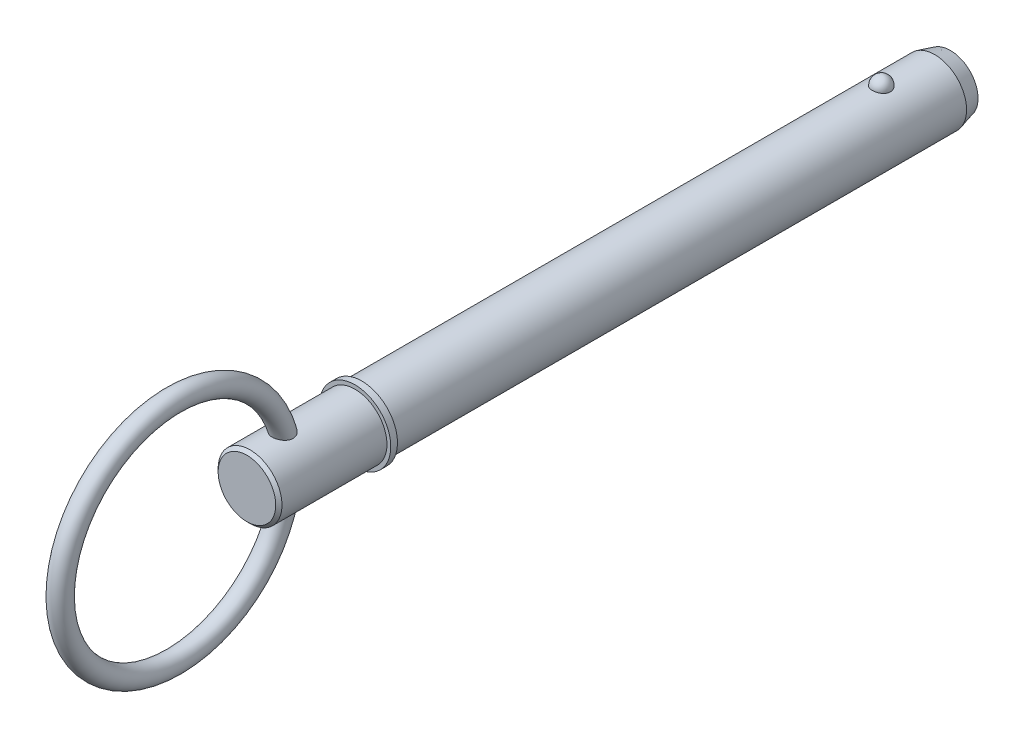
from build123d import *

# Parameters (mm, degrees)
SKETCH2_R           = 7.145
BOSS_EXTRUDE1_DEPTH = 114.3
BOSS_EXTRUDE2_START = 17.45
SKETCH3_R           = 7.145
BOSS_EXTRUDE2_DEPTH = 17.45
CHAMFER1_SIZE       = 3.5
CHAMFER1_SIZE2      = 0.937822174
SKETCH20_W          = 1.5
SKETCH20_H          = 8
SKETCH21_R          = 7.145
BOSS_EXTRUDE3_DEPTH = 25.7
CHAMFER2_SIZE       = 0.7
SKETCH24_R          = 2.25


with BuildPart() as part:
    # Sketch2 → Boss-Extrude1 (new body)
    with BuildSketch(Plane.XY):
        Circle(SKETCH2_R)
    extrude(amount=BOSS_EXTRUDE1_DEPTH)

    # Sketch3 → Boss-Extrude2 (add)
    with BuildSketch(Plane(origin=(0, 0, 0), x_dir=(-1, 0, 0), z_dir=(0, 0, -1)).offset(BOSS_EXTRUDE2_START)):
        Circle(SKETCH3_R)
    extrude(amount=-BOSS_EXTRUDE2_DEPTH)

    # Chamfer1
    chamfer1_edges = [part.edges().sort_by_distance(p)[0] for p in [
        (7.145, 0, -17.45),
    ]]
    chamfer1_side = [part.faces().sort_by_distance(p)[0] for p in [
        (7.145, 0, -8.725),
    ]]
    chamfer(chamfer1_edges, length=CHAMFER1_SIZE, length2=CHAMFER1_SIZE2, reference=chamfer1_side[0])

    # Sketch18 → Revolve1 (revolve)
    with BuildSketch(Plane(origin=(0, 0, 0), x_dir=(0, 0, -1), z_dir=(1, 0, 0))):
        with BuildLine():
            Line((2.02, 9.165), (2.02, 5.125))
            ThreePointArc((2.02, 5.125), (0, 7.145), (2.02, 9.165))
        make_face()
    revolve(axis=Axis((0, 9.165, -2.02), (0, -1, 0)))

    # Sketch20 → Revolve2 (revolve)
    with BuildSketch(Plane(origin=(0, 0, 0), x_dir=(0, 0, -1), z_dir=(1, 0, 0)), mode=Mode.PRIVATE) as revolve2_sk:
        with Locations((-115.05, 4)):
            Rectangle(SKETCH20_W, SKETCH20_H)
    revolve(revolve2_sk.sketch.rotate(Axis((0, 0, 33.728787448), (0, 0, 1)), 90), axis=Axis((0, 0, 33.728787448), (0, 0, 1)))

    # Sketch21 → Boss-Extrude3 (add)
    with BuildSketch(Plane(origin=(0, 0, 114.3), x_dir=(-1, 0, 0), z_dir=(0, 0, -1))):
        Circle(SKETCH21_R)
    extrude(amount=-BOSS_EXTRUDE3_DEPTH)

    # Chamfer2
    chamfer2_edges = [part.edges().sort_by_distance(p)[0] for p in [
        (7.145, 0, 140),
    ]]
    chamfer(chamfer2_edges, length=CHAMFER2_SIZE)

    # Sweep1: sweep along a path in Sketch23
    with BuildLine(Plane(origin=(0, 0, 0), x_dir=(0, 0, -1), z_dir=(1, 0, 0))) as sweep1_path:
        CenterArc((-156.4, 0), 25.4, 0, 360)
    # Sketch24 → Sweep1 (sweep)
    with BuildSketch(Plane(origin=(0, 0, 0), x_dir=(1, 0, 0), z_dir=(0, 1, 0))):
        with Locations((0, -131)):
            Circle(SKETCH24_R)
    sweep(path=sweep1_path.line)


solid = part.part
